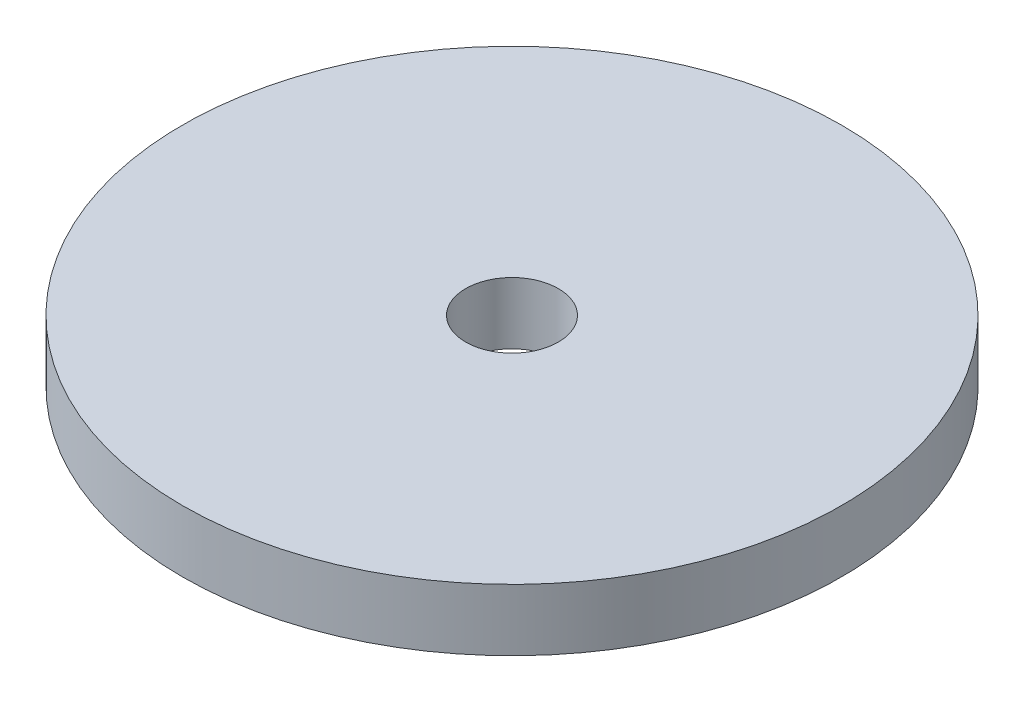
ISO-10303-21;
HEADER;
FILE_DESCRIPTION(('STEP AP214'),'2;1');
FILE_NAME('part.step','',(''),(''),'','','');
FILE_SCHEMA(('AUTOMOTIVE_DESIGN { 1 0 10303 214 1 1 1 1 }'));
ENDSEC;
DATA;
#1=APPLICATION_CONTEXT('core data for automotive mechanical design processes');
#2=APPLICATION_PROTOCOL_DEFINITION('international standard','automotive_design',2000,#1);
#3=PRODUCT_CONTEXT('',#1,'mechanical');
#4=PRODUCT('Part','Part','',(#3));
#5=PRODUCT_RELATED_PRODUCT_CATEGORY('part','',(#4));
#6=PRODUCT_DEFINITION_FORMATION('','',#4);
#7=PRODUCT_DEFINITION_CONTEXT('part definition',#1,'design');
#8=PRODUCT_DEFINITION('design','',#6,#7);
#9=PRODUCT_DEFINITION_SHAPE('','',#8);
#10=(LENGTH_UNIT() NAMED_UNIT(*) SI_UNIT(.MILLI.,.METRE.));
#11=(NAMED_UNIT(*) PLANE_ANGLE_UNIT() SI_UNIT($,.RADIAN.));
#12=(NAMED_UNIT(*) SI_UNIT($,.STERADIAN.) SOLID_ANGLE_UNIT());
#13=UNCERTAINTY_MEASURE_WITH_UNIT(LENGTH_MEASURE(1.E-05),#10,'distance_accuracy_value','');
#14=(GEOMETRIC_REPRESENTATION_CONTEXT(3) GLOBAL_UNCERTAINTY_ASSIGNED_CONTEXT((#13)) GLOBAL_UNIT_ASSIGNED_CONTEXT((#10,
#11,#12)) REPRESENTATION_CONTEXT('',''));
#15=CARTESIAN_POINT('',(0.,0.,0.));
#16=DIRECTION('',(0.,0.,1.));
#17=DIRECTION('',(1.,0.,0.));
#18=AXIS2_PLACEMENT_3D('',#15,#16,#17);
#19=CARTESIAN_POINT('',(0.,0.,0.));
#20=DIRECTION('',(0.,1.,0.));
#21=DIRECTION('',(0.,0.,1.));
#22=AXIS2_PLACEMENT_3D('',#19,#20,#21);
#23=PLANE('',#22);
#24=CARTESIAN_POINT('',(0.,0.,0.));
#25=DIRECTION('',(0.,1.,0.));
#26=DIRECTION('',(0.,0.,1.));
#27=AXIS2_PLACEMENT_3D('',#24,#25,#26);
#28=CIRCLE('',#27,3.571875);
#29=CARTESIAN_POINT('',(0.,0.,3.571875));
#30=VERTEX_POINT('',#29);
#31=EDGE_CURVE('E48',#30,#30,#28,.T.);
#32=ORIENTED_EDGE('',*,*,#31,.T.);
#33=EDGE_LOOP('',(#32));
#34=FACE_BOUND('',#33,.T.);
#35=CARTESIAN_POINT('',(0.,0.,0.));
#36=DIRECTION('',(0.,1.,0.));
#37=DIRECTION('',(0.,0.,1.));
#38=AXIS2_PLACEMENT_3D('',#35,#36,#37);
#39=CIRCLE('',#38,25.4);
#40=CARTESIAN_POINT('',(0.,0.,25.4));
#41=VERTEX_POINT('',#40);
#42=EDGE_CURVE('E11',#41,#41,#39,.T.);
#43=ORIENTED_EDGE('',*,*,#42,.F.);
#44=EDGE_LOOP('',(#43));
#45=FACE_BOUND('',#44,.T.);
#46=ADVANCED_FACE('F38',(#34,#45),#23,.F.);
#47=CARTESIAN_POINT('',(0.,0.,0.));
#48=DIRECTION('',(0.,1.,0.));
#49=DIRECTION('',(0.,0.,1.));
#50=AXIS2_PLACEMENT_3D('',#47,#48,#49);
#51=CYLINDRICAL_SURFACE('',#50,25.4);
#52=CARTESIAN_POINT('',(0.,4.7625,0.));
#53=DIRECTION('',(0.,1.,0.));
#54=DIRECTION('',(0.,0.,1.));
#55=AXIS2_PLACEMENT_3D('',#52,#53,#54);
#56=CIRCLE('',#55,25.4);
#57=CARTESIAN_POINT('',(0.,4.7625,25.4));
#58=VERTEX_POINT('',#57);
#59=EDGE_CURVE('E41',#58,#58,#56,.T.);
#60=CARTESIAN_POINT('',(0.,0.,25.4));
#61=CARTESIAN_POINT('',(0.,0.049609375,25.4));
#62=CARTESIAN_POINT('',(0.,0.09921875,25.4));
#63=CARTESIAN_POINT('',(0.,0.1984375,25.4));
#64=CARTESIAN_POINT('',(0.,0.248046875,25.4));
#65=CARTESIAN_POINT('',(0.,0.347265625,25.4));
#66=CARTESIAN_POINT('',(0.,0.396875,25.4));
#67=CARTESIAN_POINT('',(0.,0.49609375,25.4));
#68=CARTESIAN_POINT('',(0.,0.545703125,25.4));
#69=CARTESIAN_POINT('',(0.,0.644921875,25.4));
#70=CARTESIAN_POINT('',(0.,0.69453125,25.4));
#71=CARTESIAN_POINT('',(0.,0.79375,25.4));
#72=CARTESIAN_POINT('',(0.,0.843359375,25.4));
#73=CARTESIAN_POINT('',(0.,0.942578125,25.4));
#74=CARTESIAN_POINT('',(0.,0.9921875,25.4));
#75=CARTESIAN_POINT('',(0.,1.09140625,25.4));
#76=CARTESIAN_POINT('',(0.,1.141015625,25.4));
#77=CARTESIAN_POINT('',(0.,1.240234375,25.4));
#78=CARTESIAN_POINT('',(0.,1.28984375,25.4));
#79=CARTESIAN_POINT('',(0.,1.3890625,25.4));
#80=CARTESIAN_POINT('',(0.,1.438671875,25.4));
#81=CARTESIAN_POINT('',(0.,1.537890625,25.4));
#82=CARTESIAN_POINT('',(0.,1.5875,25.4));
#83=CARTESIAN_POINT('',(0.,1.68671875,25.4));
#84=CARTESIAN_POINT('',(0.,1.736328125,25.4));
#85=CARTESIAN_POINT('',(0.,1.835546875,25.4));
#86=CARTESIAN_POINT('',(0.,1.88515625,25.4));
#87=CARTESIAN_POINT('',(0.,1.984375,25.4));
#88=CARTESIAN_POINT('',(0.,2.033984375,25.4));
#89=CARTESIAN_POINT('',(0.,2.133203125,25.4));
#90=CARTESIAN_POINT('',(0.,2.1828125,25.4));
#91=CARTESIAN_POINT('',(0.,2.28203125,25.4));
#92=CARTESIAN_POINT('',(0.,2.331640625,25.4));
#93=CARTESIAN_POINT('',(0.,2.430859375,25.4));
#94=CARTESIAN_POINT('',(0.,2.48046875,25.4));
#95=CARTESIAN_POINT('',(0.,2.5796875,25.4));
#96=CARTESIAN_POINT('',(0.,2.629296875,25.4));
#97=CARTESIAN_POINT('',(0.,2.728515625,25.4));
#98=CARTESIAN_POINT('',(0.,2.778125,25.4));
#99=CARTESIAN_POINT('',(0.,2.87734375,25.4));
#100=CARTESIAN_POINT('',(0.,2.926953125,25.4));
#101=CARTESIAN_POINT('',(0.,3.026171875,25.4));
#102=CARTESIAN_POINT('',(0.,3.07578125,25.4));
#103=CARTESIAN_POINT('',(0.,3.175,25.4));
#104=CARTESIAN_POINT('',(0.,3.224609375,25.4));
#105=CARTESIAN_POINT('',(0.,3.323828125,25.4));
#106=CARTESIAN_POINT('',(0.,3.3734375,25.4));
#107=CARTESIAN_POINT('',(0.,3.47265625,25.4));
#108=CARTESIAN_POINT('',(0.,3.522265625,25.4));
#109=CARTESIAN_POINT('',(0.,3.621484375,25.4));
#110=CARTESIAN_POINT('',(0.,3.67109375,25.4));
#111=CARTESIAN_POINT('',(0.,3.7703125,25.4));
#112=CARTESIAN_POINT('',(0.,3.819921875,25.4));
#113=CARTESIAN_POINT('',(0.,3.919140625,25.4));
#114=CARTESIAN_POINT('',(0.,3.96875,25.4));
#115=CARTESIAN_POINT('',(0.,4.06796875,25.4));
#116=CARTESIAN_POINT('',(0.,4.117578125,25.4));
#117=CARTESIAN_POINT('',(0.,4.216796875,25.4));
#118=CARTESIAN_POINT('',(0.,4.26640625,25.4));
#119=CARTESIAN_POINT('',(0.,4.365625,25.4));
#120=CARTESIAN_POINT('',(0.,4.415234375,25.4));
#121=CARTESIAN_POINT('',(0.,4.514453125,25.4));
#122=CARTESIAN_POINT('',(0.,4.5640625,25.4));
#123=CARTESIAN_POINT('',(0.,4.66328125,25.4));
#124=CARTESIAN_POINT('',(0.,4.712890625,25.4));
#125=CARTESIAN_POINT('',(0.,4.7625,25.4));
#126=B_SPLINE_CURVE_WITH_KNOTS('',3,(#60,#61,#62,#63,#64,#65,#66,#67,#68,#69,#70,#71,#72,#73,
#74,#75,#76,#77,#78,#79,#80,#81,#82,#83,#84,#85,#86,#87,#88,#89,#90,#91,#92,#93,#94,#95,#96,#97,
#98,#99,#100,#101,#102,#103,#104,#105,#106,#107,#108,#109,#110,#111,#112,#113,#114,#115,#116,
#117,#118,#119,#120,#121,#122,#123,#124,#125),.UNSPECIFIED.,.F.,.F.,(4,2,2,2,2,2,2,2,2,2,2,2,2,
2,2,2,2,2,2,2,2,2,2,2,2,2,2,2,2,2,2,2,4),(0.,0.148828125,0.29765625,0.446484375,0.5953125,
0.744140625,0.89296875,1.041796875,1.190625,1.339453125,1.48828125,1.637109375,1.7859375,
1.934765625,2.08359375,2.232421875,2.38125,2.530078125,2.67890625,2.827734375,2.9765625,
3.125390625,3.27421875,3.423046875,3.571875,3.720703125,3.86953125,4.018359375,4.1671875,
4.316015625,4.46484375,4.613671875,4.7625),.UNSPECIFIED.);
#127=EDGE_CURVE('BSEAM61',#41,#58,#126,.T.);
#128=ORIENTED_EDGE('',*,*,#42,.T.);
#129=ORIENTED_EDGE('',*,*,#59,.F.);
#130=ORIENTED_EDGE('',*,*,#127,.T.);
#131=ORIENTED_EDGE('',*,*,#127,.F.);
#132=EDGE_LOOP('',(#128,#130,#129,#131));
#133=FACE_BOUND('',#132,.T.);
#134=ADVANCED_FACE('F61',(#133),#51,.T.);
#135=CARTESIAN_POINT('',(0.,4.7625,0.));
#136=DIRECTION('',(0.,1.,0.));
#137=DIRECTION('',(0.,0.,1.));
#138=AXIS2_PLACEMENT_3D('',#135,#136,#137);
#139=PLANE('',#138);
#140=CARTESIAN_POINT('',(0.,4.7625,0.));
#141=DIRECTION('',(0.,1.,0.));
#142=DIRECTION('',(0.,0.,1.));
#143=AXIS2_PLACEMENT_3D('',#140,#141,#142);
#144=CIRCLE('',#143,3.571875);
#145=CARTESIAN_POINT('',(0.,4.7625,3.571875));
#146=VERTEX_POINT('',#145);
#147=EDGE_CURVE('E52',#146,#146,#144,.T.);
#148=ORIENTED_EDGE('',*,*,#147,.F.);
#149=EDGE_LOOP('',(#148));
#150=FACE_BOUND('',#149,.T.);
#151=ORIENTED_EDGE('',*,*,#59,.T.);
#152=EDGE_LOOP('',(#151));
#153=FACE_BOUND('',#152,.T.);
#154=ADVANCED_FACE('F58',(#150,#153),#139,.T.);
#155=CARTESIAN_POINT('',(0.,4.7625,0.));
#156=DIRECTION('',(0.,1.,0.));
#157=DIRECTION('',(0.,0.,1.));
#158=AXIS2_PLACEMENT_3D('',#155,#156,#157);
#159=CYLINDRICAL_SURFACE('',#158,3.571875);
#160=ORIENTED_EDGE('',*,*,#31,.F.);
#161=EDGE_LOOP('',(#160));
#162=FACE_BOUND('',#161,.T.);
#163=ORIENTED_EDGE('',*,*,#147,.T.);
#164=EDGE_LOOP('',(#163));
#165=FACE_BOUND('',#164,.T.);
#166=ADVANCED_FACE('F56',(#162,#165),#159,.F.);
#167=CLOSED_SHELL('',(#46,#134,#154,#166));
#168=MANIFOLD_SOLID_BREP('B2',#167);
#169=ADVANCED_BREP_SHAPE_REPRESENTATION('',(#18,#168),#14);
#170=SHAPE_DEFINITION_REPRESENTATION(#9,#169);
ENDSEC;
END-ISO-10303-21;
